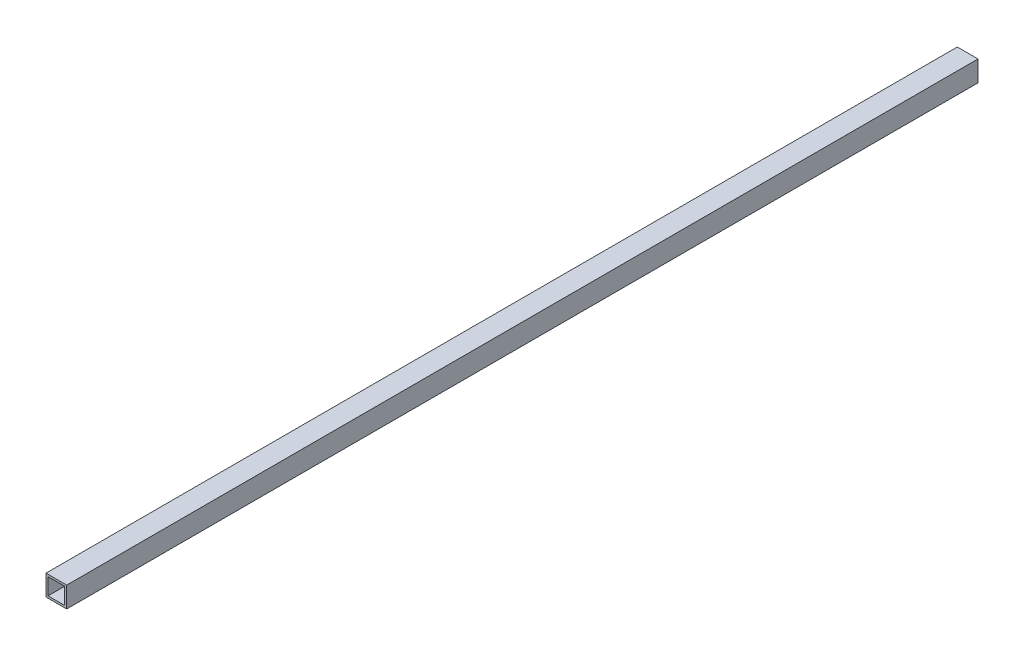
ISO-10303-21;
HEADER;
FILE_DESCRIPTION(('STEP AP214'),'2;1');
FILE_NAME('part.step','',(''),(''),'','','');
FILE_SCHEMA(('AUTOMOTIVE_DESIGN { 1 0 10303 214 1 1 1 1 }'));
ENDSEC;
DATA;
#1=APPLICATION_CONTEXT('core data for automotive mechanical design processes');
#2=APPLICATION_PROTOCOL_DEFINITION('international standard','automotive_design',2000,#1);
#3=PRODUCT_CONTEXT('',#1,'mechanical');
#4=PRODUCT('Part','Part','',(#3));
#5=PRODUCT_RELATED_PRODUCT_CATEGORY('part','',(#4));
#6=PRODUCT_DEFINITION_FORMATION('','',#4);
#7=PRODUCT_DEFINITION_CONTEXT('part definition',#1,'design');
#8=PRODUCT_DEFINITION('design','',#6,#7);
#9=PRODUCT_DEFINITION_SHAPE('','',#8);
#10=(LENGTH_UNIT() NAMED_UNIT(*) SI_UNIT(.MILLI.,.METRE.));
#11=(NAMED_UNIT(*) PLANE_ANGLE_UNIT() SI_UNIT($,.RADIAN.));
#12=(NAMED_UNIT(*) SI_UNIT($,.STERADIAN.) SOLID_ANGLE_UNIT());
#13=UNCERTAINTY_MEASURE_WITH_UNIT(LENGTH_MEASURE(1.E-05),#10,'distance_accuracy_value','');
#14=(GEOMETRIC_REPRESENTATION_CONTEXT(3) GLOBAL_UNCERTAINTY_ASSIGNED_CONTEXT((#13)) GLOBAL_UNIT_ASSIGNED_CONTEXT((#10,
#11,#12)) REPRESENTATION_CONTEXT('',''));
#15=CARTESIAN_POINT('',(0.,0.,0.));
#16=DIRECTION('',(0.,0.,1.));
#17=DIRECTION('',(1.,0.,0.));
#18=AXIS2_PLACEMENT_3D('',#15,#16,#17);
#19=CARTESIAN_POINT('',(0.,0.,2200.));
#20=DIRECTION('',(0.,0.,1.));
#21=DIRECTION('',(1.,0.,0.));
#22=AXIS2_PLACEMENT_3D('',#19,#20,#21);
#23=PLANE('',#22);
#24=DIRECTION('',(0.,1.,0.));
#25=VECTOR('',#24,1.);
#26=CARTESIAN_POINT('',(0.,0.,2200.));
#27=LINE('',#26,#25);
#28=CARTESIAN_POINT('',(0.,0.,2200.));
#29=VERTEX_POINT('',#28);
#30=CARTESIAN_POINT('',(0.,50.,2200.));
#31=VERTEX_POINT('',#30);
#32=EDGE_CURVE('E141',#29,#31,#27,.T.);
#33=ORIENTED_EDGE('',*,*,#32,.T.);
#34=DIRECTION('',(-1.,0.,0.));
#35=VECTOR('',#34,1.);
#36=CARTESIAN_POINT('',(0.,50.,2200.));
#37=LINE('',#36,#35);
#38=CARTESIAN_POINT('',(-50.,50.,2200.));
#39=VERTEX_POINT('',#38);
#40=EDGE_CURVE('E144',#31,#39,#37,.T.);
#41=ORIENTED_EDGE('',*,*,#40,.T.);
#42=DIRECTION('',(0.,-1.,0.));
#43=VECTOR('',#42,1.);
#44=CARTESIAN_POINT('',(-50.,0.,2200.));
#45=LINE('',#44,#43);
#46=CARTESIAN_POINT('',(-50.,0.,2200.));
#47=VERTEX_POINT('',#46);
#48=EDGE_CURVE('E147',#39,#47,#45,.T.);
#49=ORIENTED_EDGE('',*,*,#48,.T.);
#50=DIRECTION('',(1.,0.,0.));
#51=VECTOR('',#50,1.);
#52=CARTESIAN_POINT('',(0.,0.,2200.));
#53=LINE('',#52,#51);
#54=EDGE_CURVE('E149',#47,#29,#53,.T.);
#55=ORIENTED_EDGE('',*,*,#54,.T.);
#56=EDGE_LOOP('',(#33,#41,#49,#55));
#57=FACE_BOUND('',#56,.T.);
#58=DIRECTION('',(-1.,0.,0.));
#59=VECTOR('',#58,1.);
#60=CARTESIAN_POINT('',(-5.,45.,2200.));
#61=LINE('',#60,#59);
#62=CARTESIAN_POINT('',(-5.,45.,2200.));
#63=VERTEX_POINT('',#62);
#64=CARTESIAN_POINT('',(-45.,45.,2200.));
#65=VERTEX_POINT('',#64);
#66=EDGE_CURVE('E113',#63,#65,#61,.T.);
#67=ORIENTED_EDGE('',*,*,#66,.F.);
#68=DIRECTION('',(0.,1.,0.));
#69=VECTOR('',#68,1.);
#70=CARTESIAN_POINT('',(-5.,5.,2200.));
#71=LINE('',#70,#69);
#72=CARTESIAN_POINT('',(-5.,5.,2200.));
#73=VERTEX_POINT('',#72);
#74=EDGE_CURVE('E105',#73,#63,#71,.T.);
#75=ORIENTED_EDGE('',*,*,#74,.F.);
#76=DIRECTION('',(1.,0.,0.));
#77=VECTOR('',#76,1.);
#78=CARTESIAN_POINT('',(-5.,5.,2200.));
#79=LINE('',#78,#77);
#80=CARTESIAN_POINT('',(-45.,5.,2200.));
#81=VERTEX_POINT('',#80);
#82=EDGE_CURVE('E127',#81,#73,#79,.T.);
#83=ORIENTED_EDGE('',*,*,#82,.F.);
#84=DIRECTION('',(0.,-1.,0.));
#85=VECTOR('',#84,1.);
#86=CARTESIAN_POINT('',(-45.,5.,2200.));
#87=LINE('',#86,#85);
#88=EDGE_CURVE('E125',#65,#81,#87,.T.);
#89=ORIENTED_EDGE('',*,*,#88,.F.);
#90=EDGE_LOOP('',(#67,#75,#83,#89));
#91=FACE_BOUND('',#90,.T.);
#92=ADVANCED_FACE('F40',(#57,#91),#23,.T.);
#93=CARTESIAN_POINT('',(0.,0.,0.));
#94=DIRECTION('',(0.,0.,1.));
#95=DIRECTION('',(1.,0.,0.));
#96=AXIS2_PLACEMENT_3D('',#93,#94,#95);
#97=PLANE('',#96);
#98=DIRECTION('',(0.,1.,0.));
#99=VECTOR('',#98,1.);
#100=CARTESIAN_POINT('',(0.,0.,0.));
#101=LINE('',#100,#99);
#102=CARTESIAN_POINT('',(0.,0.,0.));
#103=VERTEX_POINT('',#102);
#104=CARTESIAN_POINT('',(0.,50.,0.));
#105=VERTEX_POINT('',#104);
#106=EDGE_CURVE('E121',#103,#105,#101,.T.);
#107=ORIENTED_EDGE('',*,*,#106,.F.);
#108=DIRECTION('',(1.,0.,0.));
#109=VECTOR('',#108,1.);
#110=CARTESIAN_POINT('',(0.,0.,0.));
#111=LINE('',#110,#109);
#112=CARTESIAN_POINT('',(-50.,0.,0.));
#113=VERTEX_POINT('',#112);
#114=EDGE_CURVE('E145',#113,#103,#111,.T.);
#115=ORIENTED_EDGE('',*,*,#114,.F.);
#116=DIRECTION('',(0.,-1.,0.));
#117=VECTOR('',#116,1.);
#118=CARTESIAN_POINT('',(-50.,0.,0.));
#119=LINE('',#118,#117);
#120=CARTESIAN_POINT('',(-50.,50.,0.));
#121=VERTEX_POINT('',#120);
#122=EDGE_CURVE('E156',#121,#113,#119,.T.);
#123=ORIENTED_EDGE('',*,*,#122,.F.);
#124=DIRECTION('',(-1.,0.,0.));
#125=VECTOR('',#124,1.);
#126=CARTESIAN_POINT('',(0.,50.,0.));
#127=LINE('',#126,#125);
#128=EDGE_CURVE('E154',#105,#121,#127,.T.);
#129=ORIENTED_EDGE('',*,*,#128,.F.);
#130=EDGE_LOOP('',(#107,#115,#123,#129));
#131=FACE_BOUND('',#130,.T.);
#132=DIRECTION('',(0.,1.,0.));
#133=VECTOR('',#132,1.);
#134=CARTESIAN_POINT('',(-5.,5.,0.));
#135=LINE('',#134,#133);
#136=CARTESIAN_POINT('',(-5.,5.,0.));
#137=VERTEX_POINT('',#136);
#138=CARTESIAN_POINT('',(-5.,45.,0.));
#139=VERTEX_POINT('',#138);
#140=EDGE_CURVE('E63',#137,#139,#135,.T.);
#141=ORIENTED_EDGE('',*,*,#140,.T.);
#142=DIRECTION('',(-1.,0.,0.));
#143=VECTOR('',#142,1.);
#144=CARTESIAN_POINT('',(-5.,45.,0.));
#145=LINE('',#144,#143);
#146=CARTESIAN_POINT('',(-45.,45.,0.));
#147=VERTEX_POINT('',#146);
#148=EDGE_CURVE('E120',#139,#147,#145,.T.);
#149=ORIENTED_EDGE('',*,*,#148,.T.);
#150=DIRECTION('',(0.,-1.,0.));
#151=VECTOR('',#150,1.);
#152=CARTESIAN_POINT('',(-45.,5.,0.));
#153=LINE('',#152,#151);
#154=CARTESIAN_POINT('',(-45.,5.,0.));
#155=VERTEX_POINT('',#154);
#156=EDGE_CURVE('E133',#147,#155,#153,.T.);
#157=ORIENTED_EDGE('',*,*,#156,.T.);
#158=DIRECTION('',(1.,0.,0.));
#159=VECTOR('',#158,1.);
#160=CARTESIAN_POINT('',(-5.,5.,0.));
#161=LINE('',#160,#159);
#162=EDGE_CURVE('E114',#155,#137,#161,.T.);
#163=ORIENTED_EDGE('',*,*,#162,.T.);
#164=EDGE_LOOP('',(#141,#149,#157,#163));
#165=FACE_BOUND('',#164,.T.);
#166=ADVANCED_FACE('F174',(#131,#165),#97,.F.);
#167=CARTESIAN_POINT('',(0.,0.,2200.));
#168=DIRECTION('',(-1.,0.,0.));
#169=DIRECTION('',(0.,-1.,0.));
#170=AXIS2_PLACEMENT_3D('',#167,#168,#169);
#171=PLANE('',#170);
#172=ORIENTED_EDGE('',*,*,#106,.T.);
#173=DIRECTION('',(0.,0.,-1.));
#174=VECTOR('',#173,1.);
#175=CARTESIAN_POINT('',(0.,50.,2200.));
#176=LINE('',#175,#174);
#177=EDGE_CURVE('E11',#31,#105,#176,.T.);
#178=ORIENTED_EDGE('',*,*,#177,.F.);
#179=ORIENTED_EDGE('',*,*,#32,.F.);
#180=DIRECTION('',(0.,0.,-1.));
#181=VECTOR('',#180,1.);
#182=CARTESIAN_POINT('',(0.,0.,2200.));
#183=LINE('',#182,#181);
#184=EDGE_CURVE('E151',#29,#103,#183,.T.);
#185=ORIENTED_EDGE('',*,*,#184,.T.);
#186=EDGE_LOOP('',(#172,#178,#179,#185));
#187=FACE_BOUND('',#186,.T.);
#188=ADVANCED_FACE('F42',(#187),#171,.F.);
#189=CARTESIAN_POINT('',(0.,50.,2200.));
#190=DIRECTION('',(0.,-1.,0.));
#191=DIRECTION('',(1.,0.,0.));
#192=AXIS2_PLACEMENT_3D('',#189,#190,#191);
#193=PLANE('',#192);
#194=ORIENTED_EDGE('',*,*,#128,.T.);
#195=DIRECTION('',(0.,0.,-1.));
#196=VECTOR('',#195,1.);
#197=CARTESIAN_POINT('',(-50.,50.,2200.));
#198=LINE('',#197,#196);
#199=EDGE_CURVE('E48',#39,#121,#198,.T.);
#200=ORIENTED_EDGE('',*,*,#199,.F.);
#201=ORIENTED_EDGE('',*,*,#40,.F.);
#202=ORIENTED_EDGE('',*,*,#177,.T.);
#203=EDGE_LOOP('',(#194,#200,#201,#202));
#204=FACE_BOUND('',#203,.T.);
#205=ADVANCED_FACE('F184',(#204),#193,.F.);
#206=CARTESIAN_POINT('',(-50.,0.,2200.));
#207=DIRECTION('',(1.,0.,0.));
#208=DIRECTION('',(0.,0.,-1.));
#209=AXIS2_PLACEMENT_3D('',#206,#207,#208);
#210=PLANE('',#209);
#211=ORIENTED_EDGE('',*,*,#122,.T.);
#212=DIRECTION('',(0.,0.,-1.));
#213=VECTOR('',#212,1.);
#214=CARTESIAN_POINT('',(-50.,0.,2200.));
#215=LINE('',#214,#213);
#216=EDGE_CURVE('E161',#47,#113,#215,.T.);
#217=ORIENTED_EDGE('',*,*,#216,.F.);
#218=ORIENTED_EDGE('',*,*,#48,.F.);
#219=ORIENTED_EDGE('',*,*,#199,.T.);
#220=EDGE_LOOP('',(#211,#217,#218,#219));
#221=FACE_BOUND('',#220,.T.);
#222=ADVANCED_FACE('F168',(#221),#210,.F.);
#223=CARTESIAN_POINT('',(0.,0.,2200.));
#224=DIRECTION('',(0.,1.,0.));
#225=DIRECTION('',(0.,0.,1.));
#226=AXIS2_PLACEMENT_3D('',#223,#224,#225);
#227=PLANE('',#226);
#228=ORIENTED_EDGE('',*,*,#114,.T.);
#229=ORIENTED_EDGE('',*,*,#184,.F.);
#230=ORIENTED_EDGE('',*,*,#54,.F.);
#231=ORIENTED_EDGE('',*,*,#216,.T.);
#232=EDGE_LOOP('',(#228,#229,#230,#231));
#233=FACE_BOUND('',#232,.T.);
#234=ADVANCED_FACE('F178',(#233),#227,.F.);
#235=CARTESIAN_POINT('',(-5.,5.,2200.));
#236=DIRECTION('',(-1.,0.,0.));
#237=DIRECTION('',(0.,0.,1.));
#238=AXIS2_PLACEMENT_3D('',#235,#236,#237);
#239=PLANE('',#238);
#240=ORIENTED_EDGE('',*,*,#140,.F.);
#241=DIRECTION('',(0.,0.,-1.));
#242=VECTOR('',#241,1.);
#243=CARTESIAN_POINT('',(-5.,5.,2200.));
#244=LINE('',#243,#242);
#245=EDGE_CURVE('E109',#73,#137,#244,.T.);
#246=ORIENTED_EDGE('',*,*,#245,.F.);
#247=ORIENTED_EDGE('',*,*,#74,.T.);
#248=DIRECTION('',(0.,0.,-1.));
#249=VECTOR('',#248,1.);
#250=CARTESIAN_POINT('',(-5.,45.,2200.));
#251=LINE('',#250,#249);
#252=EDGE_CURVE('E108',#63,#139,#251,.T.);
#253=ORIENTED_EDGE('',*,*,#252,.T.);
#254=EDGE_LOOP('',(#240,#246,#247,#253));
#255=FACE_BOUND('',#254,.T.);
#256=ADVANCED_FACE('F107',(#255),#239,.T.);
#257=CARTESIAN_POINT('',(-5.,45.,2200.));
#258=DIRECTION('',(0.,-1.,0.));
#259=DIRECTION('',(1.,0.,0.));
#260=AXIS2_PLACEMENT_3D('',#257,#258,#259);
#261=PLANE('',#260);
#262=ORIENTED_EDGE('',*,*,#148,.F.);
#263=ORIENTED_EDGE('',*,*,#252,.F.);
#264=ORIENTED_EDGE('',*,*,#66,.T.);
#265=DIRECTION('',(0.,0.,-1.));
#266=VECTOR('',#265,1.);
#267=CARTESIAN_POINT('',(-45.,45.,2200.));
#268=LINE('',#267,#266);
#269=EDGE_CURVE('E122',#65,#147,#268,.T.);
#270=ORIENTED_EDGE('',*,*,#269,.T.);
#271=EDGE_LOOP('',(#262,#263,#264,#270));
#272=FACE_BOUND('',#271,.T.);
#273=ADVANCED_FACE('F117',(#272),#261,.T.);
#274=CARTESIAN_POINT('',(-45.,5.,2200.));
#275=DIRECTION('',(1.,0.,0.));
#276=DIRECTION('',(0.,0.,-1.));
#277=AXIS2_PLACEMENT_3D('',#274,#275,#276);
#278=PLANE('',#277);
#279=ORIENTED_EDGE('',*,*,#156,.F.);
#280=ORIENTED_EDGE('',*,*,#269,.F.);
#281=ORIENTED_EDGE('',*,*,#88,.T.);
#282=DIRECTION('',(0.,0.,-1.));
#283=VECTOR('',#282,1.);
#284=CARTESIAN_POINT('',(-45.,5.,2200.));
#285=LINE('',#284,#283);
#286=EDGE_CURVE('E55',#81,#155,#285,.T.);
#287=ORIENTED_EDGE('',*,*,#286,.T.);
#288=EDGE_LOOP('',(#279,#280,#281,#287));
#289=FACE_BOUND('',#288,.T.);
#290=ADVANCED_FACE('F207',(#289),#278,.T.);
#291=CARTESIAN_POINT('',(-5.,5.,2200.));
#292=DIRECTION('',(0.,1.,0.));
#293=DIRECTION('',(0.,0.,1.));
#294=AXIS2_PLACEMENT_3D('',#291,#292,#293);
#295=PLANE('',#294);
#296=ORIENTED_EDGE('',*,*,#162,.F.);
#297=ORIENTED_EDGE('',*,*,#286,.F.);
#298=ORIENTED_EDGE('',*,*,#82,.T.);
#299=ORIENTED_EDGE('',*,*,#245,.T.);
#300=EDGE_LOOP('',(#296,#297,#298,#299));
#301=FACE_BOUND('',#300,.T.);
#302=ADVANCED_FACE('F211',(#301),#295,.T.);
#303=CLOSED_SHELL('',(#92,#166,#188,#205,#222,#234,#256,#273,#290,#302));
#304=MANIFOLD_SOLID_BREP('B2',#303);
#305=ADVANCED_BREP_SHAPE_REPRESENTATION('',(#18,#304),#14);
#306=SHAPE_DEFINITION_REPRESENTATION(#9,#305);
ENDSEC;
END-ISO-10303-21;
